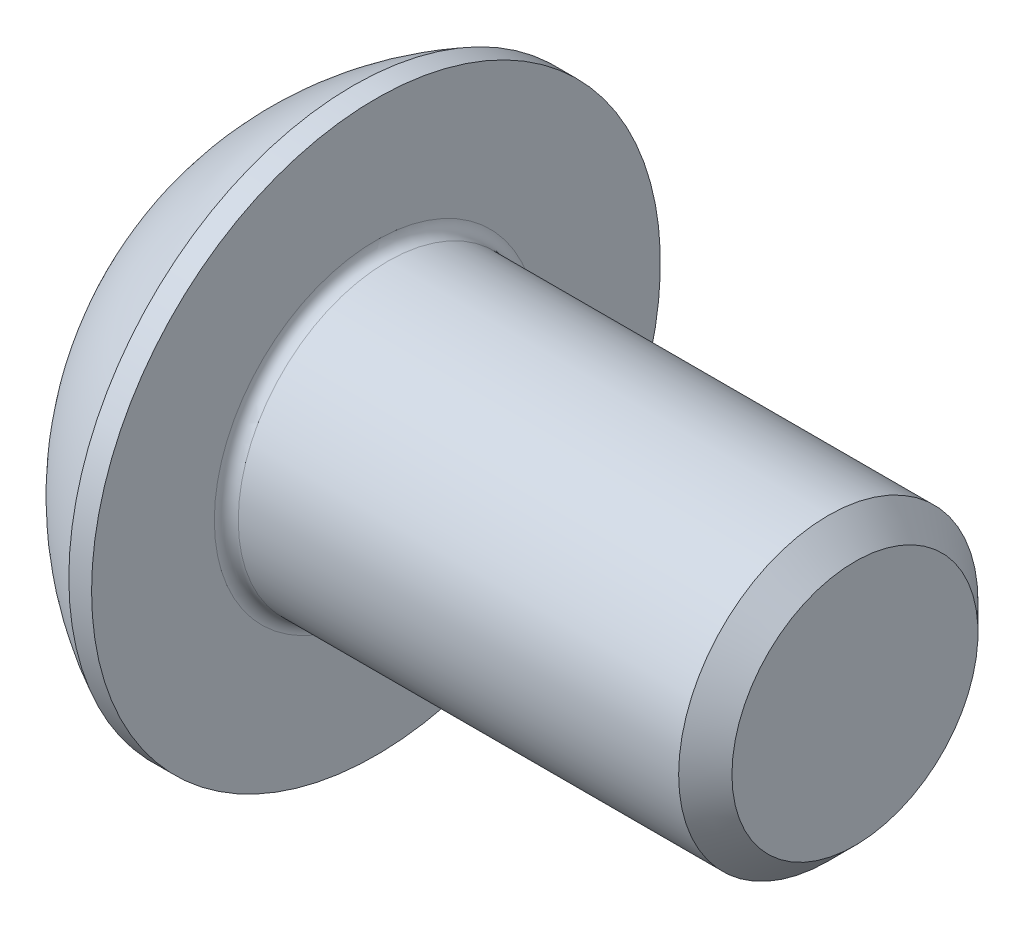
ISO-10303-21;
HEADER;
FILE_DESCRIPTION(('STEP AP214'),'2;1');
FILE_NAME('part.step','',(''),(''),'','','');
FILE_SCHEMA(('AUTOMOTIVE_DESIGN { 1 0 10303 214 1 1 1 1 }'));
ENDSEC;
DATA;
#1=APPLICATION_CONTEXT('core data for automotive mechanical design processes');
#2=APPLICATION_PROTOCOL_DEFINITION('international standard','automotive_design',2000,#1);
#3=PRODUCT_CONTEXT('',#1,'mechanical');
#4=PRODUCT('Part','Part','',(#3));
#5=PRODUCT_RELATED_PRODUCT_CATEGORY('part','',(#4));
#6=PRODUCT_DEFINITION_FORMATION('','',#4);
#7=PRODUCT_DEFINITION_CONTEXT('part definition',#1,'design');
#8=PRODUCT_DEFINITION('design','',#6,#7);
#9=PRODUCT_DEFINITION_SHAPE('','',#8);
#10=(LENGTH_UNIT() NAMED_UNIT(*) SI_UNIT(.MILLI.,.METRE.));
#11=(NAMED_UNIT(*) PLANE_ANGLE_UNIT() SI_UNIT($,.RADIAN.));
#12=(NAMED_UNIT(*) SI_UNIT($,.STERADIAN.) SOLID_ANGLE_UNIT());
#13=UNCERTAINTY_MEASURE_WITH_UNIT(LENGTH_MEASURE(1.E-05),#10,'distance_accuracy_value','');
#14=(GEOMETRIC_REPRESENTATION_CONTEXT(3) GLOBAL_UNCERTAINTY_ASSIGNED_CONTEXT((#13)) GLOBAL_UNIT_ASSIGNED_CONTEXT((#10,
#11,#12)) REPRESENTATION_CONTEXT('',''));
#15=CARTESIAN_POINT('',(0.,0.,0.));
#16=DIRECTION('',(0.,0.,1.));
#17=DIRECTION('',(1.,0.,0.));
#18=AXIS2_PLACEMENT_3D('',#15,#16,#17);
#19=CARTESIAN_POINT('',(0.,0.,0.));
#20=DIRECTION('',(-1.,0.,0.));
#21=DIRECTION('',(0.,0.,1.));
#22=AXIS2_PLACEMENT_3D('',#19,#20,#21);
#23=PLANE('',#22);
#24=CARTESIAN_POINT('',(0.,0.,0.));
#25=DIRECTION('',(-1.,0.,0.));
#26=DIRECTION('',(0.,0.,1.));
#27=AXIS2_PLACEMENT_3D('',#24,#25,#26);
#28=CIRCLE('',#27,2.375);
#29=CARTESIAN_POINT('',(0.,2.375,0.));
#30=VERTEX_POINT('',#29);
#31=EDGE_CURVE('E152',#30,#30,#28,.T.);
#32=ORIENTED_EDGE('',*,*,#31,.T.);
#33=EDGE_LOOP('',(#32));
#34=FACE_BOUND('',#33,.T.);
#35=DIRECTION('',(0.,-1.,0.));
#36=VECTOR('',#35,1.);
#37=CARTESIAN_POINT('',(0.,-0.866025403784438,1.5));
#38=LINE('',#37,#36);
#39=CARTESIAN_POINT('',(0.,0.86602540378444,1.5));
#40=VERTEX_POINT('',#39);
#41=CARTESIAN_POINT('',(0.,-0.866025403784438,1.5));
#42=VERTEX_POINT('',#41);
#43=EDGE_CURVE('E47',#40,#42,#38,.T.);
#44=ORIENTED_EDGE('',*,*,#43,.T.);
#45=DIRECTION('',(0.,-0.5,-0.866025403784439));
#46=VECTOR('',#45,1.);
#47=CARTESIAN_POINT('',(0.,-1.73205080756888,0.));
#48=LINE('',#47,#46);
#49=CARTESIAN_POINT('',(0.,-1.73205080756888,0.));
#50=VERTEX_POINT('',#49);
#51=EDGE_CURVE('E272',#42,#50,#48,.T.);
#52=ORIENTED_EDGE('',*,*,#51,.T.);
#53=DIRECTION('',(0.,0.5,-0.866025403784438));
#54=VECTOR('',#53,1.);
#55=CARTESIAN_POINT('',(0.,-0.866025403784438,-1.5));
#56=LINE('',#55,#54);
#57=CARTESIAN_POINT('',(0.,-0.866025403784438,-1.5));
#58=VERTEX_POINT('',#57);
#59=EDGE_CURVE('E127',#50,#58,#56,.T.);
#60=ORIENTED_EDGE('',*,*,#59,.T.);
#61=DIRECTION('',(0.,1.,0.));
#62=VECTOR('',#61,1.);
#63=CARTESIAN_POINT('',(0.,0.86602540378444,-1.5));
#64=LINE('',#63,#62);
#65=CARTESIAN_POINT('',(0.,0.86602540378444,-1.5));
#66=VERTEX_POINT('',#65);
#67=EDGE_CURVE('E275',#58,#66,#64,.T.);
#68=ORIENTED_EDGE('',*,*,#67,.T.);
#69=DIRECTION('',(0.,0.5,0.866025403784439));
#70=VECTOR('',#69,1.);
#71=CARTESIAN_POINT('',(0.,1.73205080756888,0.));
#72=LINE('',#71,#70);
#73=CARTESIAN_POINT('',(0.,1.73205080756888,0.));
#74=VERTEX_POINT('',#73);
#75=EDGE_CURVE('E277',#66,#74,#72,.T.);
#76=ORIENTED_EDGE('',*,*,#75,.T.);
#77=DIRECTION('',(0.,-0.5,0.866025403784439));
#78=VECTOR('',#77,1.);
#79=CARTESIAN_POINT('',(0.,0.86602540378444,1.5));
#80=LINE('',#79,#78);
#81=EDGE_CURVE('E279',#74,#40,#80,.T.);
#82=ORIENTED_EDGE('',*,*,#81,.T.);
#83=EDGE_LOOP('',(#44,#52,#60,#68,#76,#82));
#84=FACE_BOUND('',#83,.T.);
#85=ADVANCED_FACE('F32',(#34,#84),#23,.T.);
#86=CARTESIAN_POINT('',(4.75501582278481,0.,0.));
#87=DIRECTION('',(-1.,0.,0.));
#88=DIRECTION('',(0.,1.,0.));
#89=AXIS2_PLACEMENT_3D('',#86,#87,#88);
#90=SPHERICAL_SURFACE('',#89,5.3151482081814);
#91=CARTESIAN_POINT('',(2.37,0.,0.));
#92=DIRECTION('',(-1.,0.,0.));
#93=DIRECTION('',(0.,0.,1.));
#94=AXIS2_PLACEMENT_3D('',#91,#92,#93);
#95=CIRCLE('',#94,4.75);
#96=CARTESIAN_POINT('',(2.37,4.75,0.));
#97=VERTEX_POINT('',#96);
#98=EDGE_CURVE('E149',#97,#97,#95,.T.);
#99=CARTESIAN_POINT('',(2.37,4.75,0.));
#100=CARTESIAN_POINT('',(2.33822259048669,4.7340443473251,0.));
#101=CARTESIAN_POINT('',(2.30660534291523,4.71776971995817,0.));
#102=CARTESIAN_POINT('',(2.24370380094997,4.68458927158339,0.));
#103=CARTESIAN_POINT('',(2.21241950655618,4.66768345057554,0.));
#104=CARTESIAN_POINT('',(2.15019650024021,4.6332473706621,0.));
#105=CARTESIAN_POINT('',(2.11925778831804,4.6157171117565,0.));
#106=CARTESIAN_POINT('',(2.05773840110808,4.58003923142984,0.));
#107=CARTESIAN_POINT('',(2.02715772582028,4.56189161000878,0.));
#108=CARTESIAN_POINT('',(1.96636673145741,4.52498631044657,0.));
#109=CARTESIAN_POINT('',(1.93615641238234,4.50622863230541,0.));
#110=CARTESIAN_POINT('',(1.87611829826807,4.46811077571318,0.));
#111=CARTESIAN_POINT('',(1.84629050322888,4.4487505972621,0.));
#112=CARTESIAN_POINT('',(1.78702945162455,4.40943553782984,0.));
#113=CARTESIAN_POINT('',(1.75759619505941,4.38948065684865,0.));
#114=CARTESIAN_POINT('',(1.69913607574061,4.34898423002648,0.));
#115=CARTESIAN_POINT('',(1.67010921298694,4.32844268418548,0.));
#116=CARTESIAN_POINT('',(1.61247357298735,4.28678120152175,0.));
#117=CARTESIAN_POINT('',(1.58386479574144,4.265661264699,0.));
#118=CARTESIAN_POINT('',(1.52707685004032,4.22285150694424,0.));
#119=CARTESIAN_POINT('',(1.49889768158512,4.20116168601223,0.));
#120=CARTESIAN_POINT('',(1.44298030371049,4.15722089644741,0.));
#121=CARTESIAN_POINT('',(1.41524209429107,4.13496992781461,0.));
#122=CARTESIAN_POINT('',(1.36021780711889,4.08991580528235,0.));
#123=CARTESIAN_POINT('',(1.33293172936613,4.06711265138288,0.));
#124=CARTESIAN_POINT('',(1.278822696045,4.02096334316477,0.));
#125=CARTESIAN_POINT('',(1.25199974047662,3.99761718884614,0.));
#126=CARTESIAN_POINT('',(1.19882775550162,3.95039128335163,0.));
#127=CARTESIAN_POINT('',(1.172478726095,3.92651153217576,0.));
#128=CARTESIAN_POINT('',(1.1202652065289,3.87822805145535,0.));
#129=CARTESIAN_POINT('',(1.09440071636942,3.85382432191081,0.));
#130=CARTESIAN_POINT('',(1.04316669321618,3.8045027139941,0.));
#131=CARTESIAN_POINT('',(1.01779716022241,3.77958483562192,0.));
#132=CARTESIAN_POINT('',(0.9675632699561,3.72924496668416,0.));
#133=CARTESIAN_POINT('',(0.942698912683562,3.70382297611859,0.));
#134=CARTESIAN_POINT('',(0.89348538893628,3.65248512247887,0.));
#135=CARTESIAN_POINT('',(0.869136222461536,3.62656925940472,0.));
#136=CARTESIAN_POINT('',(0.82096288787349,3.57425409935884,0.));
#137=CARTESIAN_POINT('',(0.797138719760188,3.54785480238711,0.));
#138=CARTESIAN_POINT('',(0.750024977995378,3.49458340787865,0.));
#139=CARTESIAN_POINT('',(0.726735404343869,3.46771131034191,0.));
#140=CARTESIAN_POINT('',(0.680700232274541,3.41350513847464,0.));
#141=CARTESIAN_POINT('',(0.657954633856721,3.3861710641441,0.));
#142=CARTESIAN_POINT('',(0.613016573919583,3.33105194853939,0.));
#143=CARTESIAN_POINT('',(0.590824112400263,3.30326690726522,0.));
#144=CARTESIAN_POINT('',(0.547001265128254,3.24725704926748,0.));
#145=CARTESIAN_POINT('',(0.525370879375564,3.21903223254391,0.));
#146=CARTESIAN_POINT('',(0.48268089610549,3.16215419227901,0.));
#147=CARTESIAN_POINT('',(0.461621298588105,3.13350096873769,0.));
#148=CARTESIAN_POINT('',(0.420081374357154,3.07577765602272,0.));
#149=CARTESIAN_POINT('',(0.399601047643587,3.04670756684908,0.));
#150=CARTESIAN_POINT('',(0.359227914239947,2.98816223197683,0.));
#151=CARTESIAN_POINT('',(0.339335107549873,2.95868698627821,0.));
#152=CARTESIAN_POINT('',(0.300145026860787,2.89934321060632,0.));
#153=CARTESIAN_POINT('',(0.280847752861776,2.86947468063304,0.));
#154=CARTESIAN_POINT('',(0.242856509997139,2.80935636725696,0.));
#155=CARTESIAN_POINT('',(0.224162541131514,2.77910658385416,0.));
#156=CARTESIAN_POINT('',(0.187385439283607,2.71823794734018,0.));
#157=CARTESIAN_POINT('',(0.169302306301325,2.68761909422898,0.));
#158=CARTESIAN_POINT('',(0.133754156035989,2.626024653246,0.));
#159=CARTESIAN_POINT('',(0.116289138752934,2.59504906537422,0.));
#160=CARTESIAN_POINT('',(0.081984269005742,2.53275362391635,0.));
#161=CARTESIAN_POINT('',(0.0651444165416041,2.50143377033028,0.));
#162=CARTESIAN_POINT('',(0.03209660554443,2.43846244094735,0.));
#163=CARTESIAN_POINT('',(0.0158886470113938,2.40681096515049,0.));
#164=CARTESIAN_POINT('',(0.,2.375,0.));
#165=B_SPLINE_CURVE_WITH_KNOTS('',3,(#99,#100,#101,#102,#103,#104,#105,#106,#107,#108,#109,#110,
#111,#112,#113,#114,#115,#116,#117,#118,#119,#120,#121,#122,#123,#124,#125,#126,#127,#128,#129,
#130,#131,#132,#133,#134,#135,#136,#137,#138,#139,#140,#141,#142,#143,#144,#145,#146,#147,#148,
#149,#150,#151,#152,#153,#154,#155,#156,#157,#158,#159,#160,#161,#162,#163,#164),.UNSPECIFIED.,
.F.,.F.,(4,2,2,2,2,2,2,2,2,2,2,2,2,2,2,2,2,2,2,2,2,2,2,2,2,2,2,2,2,2,2,2,4),(0.,
0.106672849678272,0.213345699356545,0.320018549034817,0.426691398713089,0.533364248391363,
0.640037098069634,0.746709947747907,0.853382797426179,0.960055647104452,1.06672849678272,
1.173401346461,1.28007419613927,1.38674704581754,1.49341989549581,1.60009274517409,
1.70676559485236,1.81343844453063,1.9201112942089,2.02678414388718,2.13345699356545,
2.24012984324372,2.34680269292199,2.45347554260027,2.56014839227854,2.66682124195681,
2.77349409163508,2.88016694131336,2.98683979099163,3.0935126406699,3.20018549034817,
3.30685834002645,3.41353118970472),.UNSPECIFIED.);
#166=EDGE_CURVE('BSEAM173',#97,#30,#165,.T.);
#167=ORIENTED_EDGE('',*,*,#98,.T.);
#168=ORIENTED_EDGE('',*,*,#31,.F.);
#169=ORIENTED_EDGE('',*,*,#166,.T.);
#170=ORIENTED_EDGE('',*,*,#166,.F.);
#171=EDGE_LOOP('',(#167,#169,#168,#170));
#172=FACE_BOUND('',#171,.T.);
#173=ADVANCED_FACE('F173',(#172),#90,.T.);
#174=CARTESIAN_POINT('',(0.,0.,0.));
#175=DIRECTION('',(-1.,0.,0.));
#176=DIRECTION('',(0.,0.,1.));
#177=AXIS2_PLACEMENT_3D('',#174,#175,#176);
#178=CYLINDRICAL_SURFACE('',#177,4.75);
#179=ORIENTED_EDGE('',*,*,#98,.F.);
#180=EDGE_LOOP('',(#179));
#181=FACE_BOUND('',#180,.T.);
#182=CARTESIAN_POINT('',(2.75,0.,0.));
#183=DIRECTION('',(-1.,0.,0.));
#184=DIRECTION('',(0.,0.,1.));
#185=AXIS2_PLACEMENT_3D('',#182,#183,#184);
#186=CIRCLE('',#185,4.75);
#187=CARTESIAN_POINT('',(2.75,0.,4.75));
#188=VERTEX_POINT('',#187);
#189=EDGE_CURVE('E146',#188,#188,#186,.T.);
#190=ORIENTED_EDGE('',*,*,#189,.T.);
#191=EDGE_LOOP('',(#190));
#192=FACE_BOUND('',#191,.T.);
#193=ADVANCED_FACE('F178',(#181,#192),#178,.T.);
#194=CARTESIAN_POINT('',(2.75,2.49999999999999,0.));
#195=DIRECTION('',(-1.,0.,0.));
#196=DIRECTION('',(0.,0.,1.));
#197=AXIS2_PLACEMENT_3D('',#194,#195,#196);
#198=PLANE('',#197);
#199=CARTESIAN_POINT('',(2.75,0.,0.));
#200=DIRECTION('',(-1.,0.,0.));
#201=DIRECTION('',(0.,0.,1.));
#202=AXIS2_PLACEMENT_3D('',#199,#200,#201);
#203=CIRCLE('',#202,2.7);
#204=CARTESIAN_POINT('',(2.75,0.,2.7));
#205=VERTEX_POINT('',#204);
#206=EDGE_CURVE('E40',#205,#205,#203,.T.);
#207=ORIENTED_EDGE('',*,*,#206,.T.);
#208=EDGE_LOOP('',(#207));
#209=FACE_BOUND('',#208,.T.);
#210=ORIENTED_EDGE('',*,*,#189,.F.);
#211=EDGE_LOOP('',(#210));
#212=FACE_BOUND('',#211,.T.);
#213=ADVANCED_FACE('F157',(#209,#212),#198,.F.);
#214=CARTESIAN_POINT('',(0.,0.,0.));
#215=DIRECTION('',(-1.,0.,0.));
#216=DIRECTION('',(0.,0.,1.));
#217=AXIS2_PLACEMENT_3D('',#214,#215,#216);
#218=CYLINDRICAL_SURFACE('',#217,2.5);
#219=CARTESIAN_POINT('',(2.95,0.,0.));
#220=DIRECTION('',(-1.,0.,0.));
#221=DIRECTION('',(0.,0.,1.));
#222=AXIS2_PLACEMENT_3D('',#219,#220,#221);
#223=CIRCLE('',#222,2.5);
#224=CARTESIAN_POINT('',(2.95,0.,2.5));
#225=VERTEX_POINT('',#224);
#226=EDGE_CURVE('E11',#225,#225,#223,.F.);
#227=ORIENTED_EDGE('',*,*,#226,.T.);
#228=EDGE_LOOP('',(#227));
#229=FACE_BOUND('',#228,.T.);
#230=CARTESIAN_POINT('',(10.305,0.,0.));
#231=DIRECTION('',(-1.,0.,0.));
#232=DIRECTION('',(0.,0.,1.));
#233=AXIS2_PLACEMENT_3D('',#230,#231,#232);
#234=CIRCLE('',#233,2.5);
#235=CARTESIAN_POINT('',(10.305,0.,2.5));
#236=VERTEX_POINT('',#235);
#237=EDGE_CURVE('E143',#236,#236,#234,.T.);
#238=ORIENTED_EDGE('',*,*,#237,.T.);
#239=EDGE_LOOP('',(#238));
#240=FACE_BOUND('',#239,.T.);
#241=ADVANCED_FACE('F187',(#229,#240),#218,.T.);
#242=CARTESIAN_POINT('',(10.75,0.,0.));
#243=DIRECTION('',(-1.,0.,0.));
#244=DIRECTION('',(0.,0.,1.));
#245=AXIS2_PLACEMENT_3D('',#242,#243,#244);
#246=CONICAL_SURFACE('',#245,2.055,0.785398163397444);
#247=ORIENTED_EDGE('',*,*,#237,.F.);
#248=EDGE_LOOP('',(#247));
#249=FACE_BOUND('',#248,.T.);
#250=CARTESIAN_POINT('',(10.75,0.,0.));
#251=DIRECTION('',(-1.,0.,0.));
#252=DIRECTION('',(0.,0.,1.));
#253=AXIS2_PLACEMENT_3D('',#250,#251,#252);
#254=CIRCLE('',#253,2.055);
#255=CARTESIAN_POINT('',(10.75,0.,2.055));
#256=VERTEX_POINT('',#255);
#257=EDGE_CURVE('E139',#256,#256,#254,.T.);
#258=ORIENTED_EDGE('',*,*,#257,.T.);
#259=EDGE_LOOP('',(#258));
#260=FACE_BOUND('',#259,.T.);
#261=ADVANCED_FACE('F168',(#249,#260),#246,.T.);
#262=CARTESIAN_POINT('',(10.75,0.,0.));
#263=DIRECTION('',(-1.,0.,0.));
#264=DIRECTION('',(0.,0.,1.));
#265=AXIS2_PLACEMENT_3D('',#262,#263,#264);
#266=PLANE('',#265);
#267=ORIENTED_EDGE('',*,*,#257,.F.);
#268=EDGE_LOOP('',(#267));
#269=FACE_BOUND('',#268,.T.);
#270=ADVANCED_FACE('F161',(#269),#266,.F.);
#271=CARTESIAN_POINT('',(2.95,0.,0.));
#272=DIRECTION('',(-1.,0.,0.));
#273=DIRECTION('',(0.,0.,1.));
#274=AXIS2_PLACEMENT_3D('',#271,#272,#273);
#275=TOROIDAL_SURFACE('',#274,2.7,0.2);
#276=ORIENTED_EDGE('',*,*,#226,.F.);
#277=EDGE_LOOP('',(#276));
#278=FACE_BOUND('',#277,.T.);
#279=ORIENTED_EDGE('',*,*,#206,.F.);
#280=EDGE_LOOP('',(#279));
#281=FACE_BOUND('',#280,.T.);
#282=ADVANCED_FACE('F34',(#278,#281),#275,.F.);
#283=CARTESIAN_POINT('',(1.56,-1.73205080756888,0.));
#284=DIRECTION('',(0.,0.866025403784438,-0.5));
#285=DIRECTION('',(0.,0.5,0.866025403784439));
#286=AXIS2_PLACEMENT_3D('',#283,#284,#285);
#287=PLANE('',#286);
#288=DIRECTION('',(0.,-0.5,-0.866025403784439));
#289=VECTOR('',#288,1.);
#290=CARTESIAN_POINT('',(1.56,-1.73205080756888,0.));
#291=LINE('',#290,#289);
#292=CARTESIAN_POINT('',(1.56,-0.866025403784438,1.5));
#293=VERTEX_POINT('',#292);
#294=CARTESIAN_POINT('',(1.56,-1.29903810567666,0.75));
#295=VERTEX_POINT('',#294);
#296=EDGE_CURVE('E113',#293,#295,#291,.T.);
#297=ORIENTED_EDGE('',*,*,#296,.T.);
#298=CARTESIAN_POINT('',(1.56,-1.73205080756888,0.));
#299=VERTEX_POINT('',#298);
#300=EDGE_CURVE('E108',#295,#299,#291,.T.);
#301=ORIENTED_EDGE('',*,*,#300,.T.);
#302=DIRECTION('',(-1.,0.,0.));
#303=VECTOR('',#302,1.);
#304=CARTESIAN_POINT('',(1.56,-1.73205080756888,0.));
#305=LINE('',#304,#303);
#306=EDGE_CURVE('E110',#299,#50,#305,.T.);
#307=ORIENTED_EDGE('',*,*,#306,.T.);
#308=ORIENTED_EDGE('',*,*,#51,.F.);
#309=DIRECTION('',(-1.,0.,0.));
#310=VECTOR('',#309,1.);
#311=CARTESIAN_POINT('',(1.56,-0.866025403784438,1.5));
#312=LINE('',#311,#310);
#313=EDGE_CURVE('E268',#293,#42,#312,.T.);
#314=ORIENTED_EDGE('',*,*,#313,.F.);
#315=EDGE_LOOP('',(#297,#301,#307,#308,#314));
#316=FACE_BOUND('',#315,.T.);
#317=ADVANCED_FACE('F109',(#316),#287,.T.);
#318=CARTESIAN_POINT('',(1.56,-0.866025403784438,-1.5));
#319=DIRECTION('',(0.,0.866025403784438,0.5));
#320=DIRECTION('',(0.,-0.5,0.866025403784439));
#321=AXIS2_PLACEMENT_3D('',#318,#319,#320);
#322=PLANE('',#321);
#323=DIRECTION('',(0.,0.5,-0.866025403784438));
#324=VECTOR('',#323,1.);
#325=CARTESIAN_POINT('',(1.56,-0.866025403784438,-1.5));
#326=LINE('',#325,#324);
#327=CARTESIAN_POINT('',(1.56,-1.29903810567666,-0.75));
#328=VERTEX_POINT('',#327);
#329=EDGE_CURVE('E55',#299,#328,#326,.T.);
#330=ORIENTED_EDGE('',*,*,#329,.T.);
#331=CARTESIAN_POINT('',(1.56,-0.866025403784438,-1.5));
#332=VERTEX_POINT('',#331);
#333=EDGE_CURVE('E122',#328,#332,#326,.T.);
#334=ORIENTED_EDGE('',*,*,#333,.T.);
#335=DIRECTION('',(-1.,0.,0.));
#336=VECTOR('',#335,1.);
#337=CARTESIAN_POINT('',(1.56,-0.866025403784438,-1.5));
#338=LINE('',#337,#336);
#339=EDGE_CURVE('E129',#332,#58,#338,.T.);
#340=ORIENTED_EDGE('',*,*,#339,.T.);
#341=ORIENTED_EDGE('',*,*,#59,.F.);
#342=ORIENTED_EDGE('',*,*,#306,.F.);
#343=EDGE_LOOP('',(#330,#334,#340,#341,#342));
#344=FACE_BOUND('',#343,.T.);
#345=ADVANCED_FACE('F125',(#344),#322,.T.);
#346=CARTESIAN_POINT('',(1.56,0.86602540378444,-1.5));
#347=DIRECTION('',(0.,0.,1.));
#348=DIRECTION('',(0.,-1.,0.));
#349=AXIS2_PLACEMENT_3D('',#346,#347,#348);
#350=PLANE('',#349);
#351=DIRECTION('',(0.,1.,0.));
#352=VECTOR('',#351,1.);
#353=CARTESIAN_POINT('',(1.56,0.86602540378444,-1.5));
#354=LINE('',#353,#352);
#355=CARTESIAN_POINT('',(1.56,0.,-1.5));
#356=VERTEX_POINT('',#355);
#357=EDGE_CURVE('E249',#332,#356,#354,.T.);
#358=ORIENTED_EDGE('',*,*,#357,.T.);
#359=CARTESIAN_POINT('',(1.56,0.86602540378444,-1.5));
#360=VERTEX_POINT('',#359);
#361=EDGE_CURVE('E121',#356,#360,#354,.T.);
#362=ORIENTED_EDGE('',*,*,#361,.T.);
#363=DIRECTION('',(-1.,0.,0.));
#364=VECTOR('',#363,1.);
#365=CARTESIAN_POINT('',(1.56,0.86602540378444,-1.5));
#366=LINE('',#365,#364);
#367=EDGE_CURVE('E134',#360,#66,#366,.T.);
#368=ORIENTED_EDGE('',*,*,#367,.T.);
#369=ORIENTED_EDGE('',*,*,#67,.F.);
#370=ORIENTED_EDGE('',*,*,#339,.F.);
#371=EDGE_LOOP('',(#358,#362,#368,#369,#370));
#372=FACE_BOUND('',#371,.T.);
#373=ADVANCED_FACE('F201',(#372),#350,.T.);
#374=CARTESIAN_POINT('',(1.56,1.73205080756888,0.));
#375=DIRECTION('',(0.,-0.866025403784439,0.5));
#376=DIRECTION('',(0.,-0.5,-0.866025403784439));
#377=AXIS2_PLACEMENT_3D('',#374,#375,#376);
#378=PLANE('',#377);
#379=DIRECTION('',(0.,0.5,0.866025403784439));
#380=VECTOR('',#379,1.);
#381=CARTESIAN_POINT('',(1.56,1.73205080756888,0.));
#382=LINE('',#381,#380);
#383=CARTESIAN_POINT('',(1.56,1.29903810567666,-0.750000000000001));
#384=VERTEX_POINT('',#383);
#385=EDGE_CURVE('E238',#360,#384,#382,.T.);
#386=ORIENTED_EDGE('',*,*,#385,.T.);
#387=CARTESIAN_POINT('',(1.56,1.73205080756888,0.));
#388=VERTEX_POINT('',#387);
#389=EDGE_CURVE('E243',#384,#388,#382,.T.);
#390=ORIENTED_EDGE('',*,*,#389,.T.);
#391=DIRECTION('',(-1.,0.,0.));
#392=VECTOR('',#391,1.);
#393=CARTESIAN_POINT('',(1.56,1.73205080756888,0.));
#394=LINE('',#393,#392);
#395=EDGE_CURVE('E283',#388,#74,#394,.T.);
#396=ORIENTED_EDGE('',*,*,#395,.T.);
#397=ORIENTED_EDGE('',*,*,#75,.F.);
#398=ORIENTED_EDGE('',*,*,#367,.F.);
#399=EDGE_LOOP('',(#386,#390,#396,#397,#398));
#400=FACE_BOUND('',#399,.T.);
#401=ADVANCED_FACE('F204',(#400),#378,.T.);
#402=CARTESIAN_POINT('',(1.56,0.86602540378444,1.5));
#403=DIRECTION('',(0.,-0.866025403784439,-0.5));
#404=DIRECTION('',(0.,0.5,-0.866025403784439));
#405=AXIS2_PLACEMENT_3D('',#402,#403,#404);
#406=PLANE('',#405);
#407=DIRECTION('',(0.,-0.5,0.866025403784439));
#408=VECTOR('',#407,1.);
#409=CARTESIAN_POINT('',(1.56,0.86602540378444,1.5));
#410=LINE('',#409,#408);
#411=CARTESIAN_POINT('',(1.56,1.29903810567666,0.75));
#412=VERTEX_POINT('',#411);
#413=EDGE_CURVE('E246',#388,#412,#410,.T.);
#414=ORIENTED_EDGE('',*,*,#413,.T.);
#415=CARTESIAN_POINT('',(1.56,0.86602540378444,1.5));
#416=VERTEX_POINT('',#415);
#417=EDGE_CURVE('E254',#412,#416,#410,.T.);
#418=ORIENTED_EDGE('',*,*,#417,.T.);
#419=DIRECTION('',(-1.,0.,0.));
#420=VECTOR('',#419,1.);
#421=CARTESIAN_POINT('',(1.56,0.86602540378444,1.5));
#422=LINE('',#421,#420);
#423=EDGE_CURVE('E267',#416,#40,#422,.T.);
#424=ORIENTED_EDGE('',*,*,#423,.T.);
#425=ORIENTED_EDGE('',*,*,#81,.F.);
#426=ORIENTED_EDGE('',*,*,#395,.F.);
#427=EDGE_LOOP('',(#414,#418,#424,#425,#426));
#428=FACE_BOUND('',#427,.T.);
#429=ADVANCED_FACE('F208',(#428),#406,.T.);
#430=CARTESIAN_POINT('',(1.56,-0.866025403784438,1.5));
#431=DIRECTION('',(0.,0.,-1.));
#432=DIRECTION('',(0.,1.,0.));
#433=AXIS2_PLACEMENT_3D('',#430,#431,#432);
#434=PLANE('',#433);
#435=DIRECTION('',(0.,-1.,0.));
#436=VECTOR('',#435,1.);
#437=CARTESIAN_POINT('',(1.56,-0.866025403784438,1.5));
#438=LINE('',#437,#436);
#439=CARTESIAN_POINT('',(1.56,0.,1.5));
#440=VERTEX_POINT('',#439);
#441=EDGE_CURVE('E260',#416,#440,#438,.T.);
#442=ORIENTED_EDGE('',*,*,#441,.T.);
#443=EDGE_CURVE('E262',#440,#293,#438,.T.);
#444=ORIENTED_EDGE('',*,*,#443,.T.);
#445=ORIENTED_EDGE('',*,*,#313,.T.);
#446=ORIENTED_EDGE('',*,*,#43,.F.);
#447=ORIENTED_EDGE('',*,*,#423,.F.);
#448=EDGE_LOOP('',(#442,#444,#445,#446,#447));
#449=FACE_BOUND('',#448,.T.);
#450=ADVANCED_FACE('F212',(#449),#434,.T.);
#451=CARTESIAN_POINT('',(1.56,-1.73205080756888,0.));
#452=DIRECTION('',(1.,0.,0.));
#453=DIRECTION('',(0.,0.,-1.));
#454=AXIS2_PLACEMENT_3D('',#451,#452,#453);
#455=PLANE('',#454);
#456=CARTESIAN_POINT('',(1.56,0.,0.));
#457=DIRECTION('',(-1.,0.,0.));
#458=DIRECTION('',(0.,0.,1.));
#459=AXIS2_PLACEMENT_3D('',#456,#457,#458);
#460=CIRCLE('',#459,1.5);
#461=EDGE_CURVE('E235',#384,#356,#460,.T.);
#462=ORIENTED_EDGE('',*,*,#461,.F.);
#463=ORIENTED_EDGE('',*,*,#385,.F.);
#464=ORIENTED_EDGE('',*,*,#361,.F.);
#465=EDGE_LOOP('',(#462,#463,#464));
#466=FACE_BOUND('',#465,.T.);
#467=ADVANCED_FACE('F216',(#466),#455,.F.);
#468=EDGE_CURVE('E140',#412,#384,#460,.T.);
#469=ORIENTED_EDGE('',*,*,#468,.F.);
#470=ORIENTED_EDGE('',*,*,#413,.F.);
#471=ORIENTED_EDGE('',*,*,#389,.F.);
#472=EDGE_LOOP('',(#469,#470,#471));
#473=FACE_BOUND('',#472,.T.);
#474=ADVANCED_FACE('F225',(#473),#455,.F.);
#475=EDGE_CURVE('E133',#440,#412,#460,.T.);
#476=ORIENTED_EDGE('',*,*,#475,.F.);
#477=ORIENTED_EDGE('',*,*,#441,.F.);
#478=ORIENTED_EDGE('',*,*,#417,.F.);
#479=EDGE_LOOP('',(#476,#477,#478));
#480=FACE_BOUND('',#479,.T.);
#481=ADVANCED_FACE('F230',(#480),#455,.F.);
#482=EDGE_CURVE('E128',#295,#440,#460,.T.);
#483=ORIENTED_EDGE('',*,*,#482,.F.);
#484=ORIENTED_EDGE('',*,*,#296,.F.);
#485=ORIENTED_EDGE('',*,*,#443,.F.);
#486=EDGE_LOOP('',(#483,#484,#485));
#487=FACE_BOUND('',#486,.T.);
#488=ADVANCED_FACE('F223',(#487),#455,.F.);
#489=EDGE_CURVE('E119',#328,#295,#460,.T.);
#490=ORIENTED_EDGE('',*,*,#489,.F.);
#491=ORIENTED_EDGE('',*,*,#329,.F.);
#492=ORIENTED_EDGE('',*,*,#300,.F.);
#493=EDGE_LOOP('',(#490,#491,#492));
#494=FACE_BOUND('',#493,.T.);
#495=ADVANCED_FACE('F118',(#494),#455,.F.);
#496=EDGE_CURVE('E241',#356,#328,#460,.T.);
#497=ORIENTED_EDGE('',*,*,#496,.F.);
#498=ORIENTED_EDGE('',*,*,#357,.F.);
#499=ORIENTED_EDGE('',*,*,#333,.F.);
#500=EDGE_LOOP('',(#497,#498,#499));
#501=FACE_BOUND('',#500,.T.);
#502=ADVANCED_FACE('F196',(#501),#455,.F.);
#503=CARTESIAN_POINT('',(2.42602540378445,0.,0.));
#504=DIRECTION('',(-1.,0.,0.));
#505=DIRECTION('',(0.,0.,1.));
#506=AXIS2_PLACEMENT_3D('',#503,#504,#505);
#507=CONICAL_SURFACE('',#506,0.,1.04719755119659);
#508=ORIENTED_EDGE('',*,*,#475,.T.);
#509=ORIENTED_EDGE('',*,*,#468,.T.);
#510=ORIENTED_EDGE('',*,*,#461,.T.);
#511=ORIENTED_EDGE('',*,*,#496,.T.);
#512=ORIENTED_EDGE('',*,*,#489,.T.);
#513=ORIENTED_EDGE('',*,*,#482,.T.);
#514=EDGE_LOOP('',(#508,#509,#510,#511,#512,#513));
#515=FACE_BOUND('',#514,.T.);
#516=CARTESIAN_POINT('',(2.42602540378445,0.,0.));
#517=VERTEX_POINT('',#516);
#518=VERTEX_LOOP('',#517);
#519=FACE_BOUND('',#518,.T.);
#520=ADVANCED_FACE('F194',(#515,#519),#507,.F.);
#521=CLOSED_SHELL('',(#85,#173,#193,#213,#241,#261,#270,#282,#317,#345,#373,#401,#429,#450,#467,
#474,#481,#488,#495,#502,#520));
#522=MANIFOLD_SOLID_BREP('B2',#521);
#523=ADVANCED_BREP_SHAPE_REPRESENTATION('',(#18,#522),#14);
#524=SHAPE_DEFINITION_REPRESENTATION(#9,#523);
ENDSEC;
END-ISO-10303-21;
